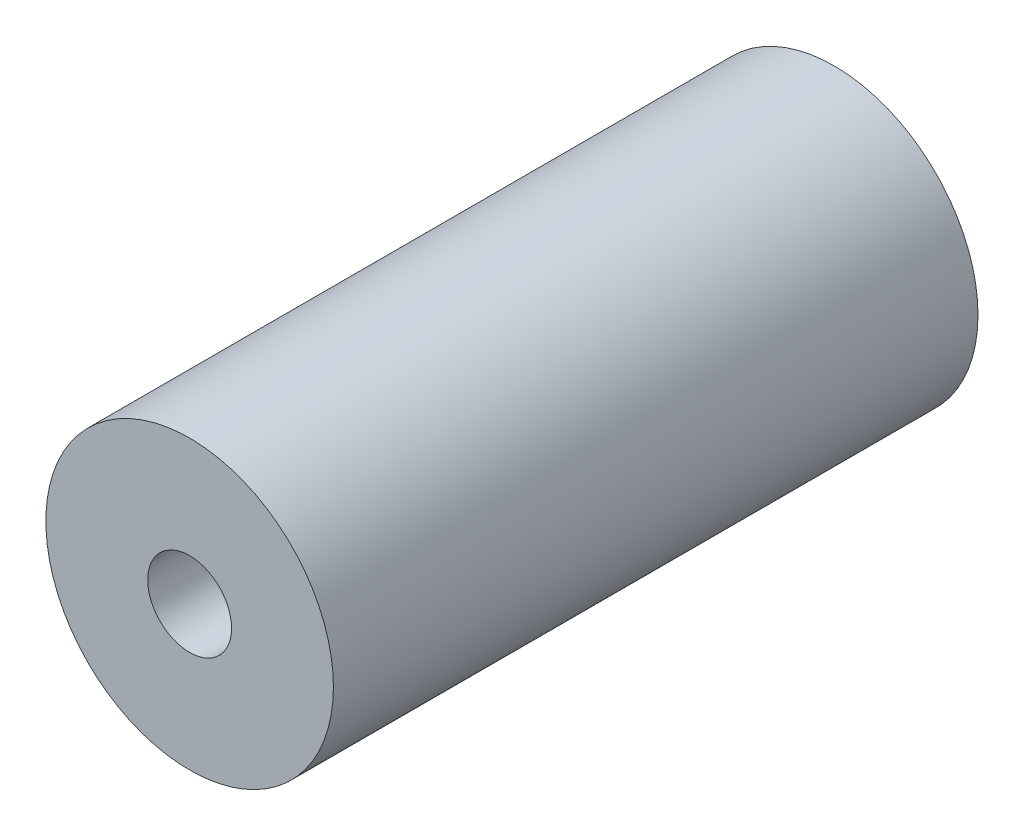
from build123d import *

# Parameters (mm, degrees)
ESQUISSE1_R        = 6
ESQUISSE1_R_2      = 1.75
BOSS_EXTRU_1_DEPTH = 26.9


with BuildPart() as part:
    # Esquisse1 → Boss.-Extru.1 (new body)
    with BuildSketch(Plane.XY):
        Circle(ESQUISSE1_R)
        Circle(ESQUISSE1_R_2, mode=Mode.SUBTRACT)
    extrude(amount=BOSS_EXTRU_1_DEPTH)


solid = part.part
